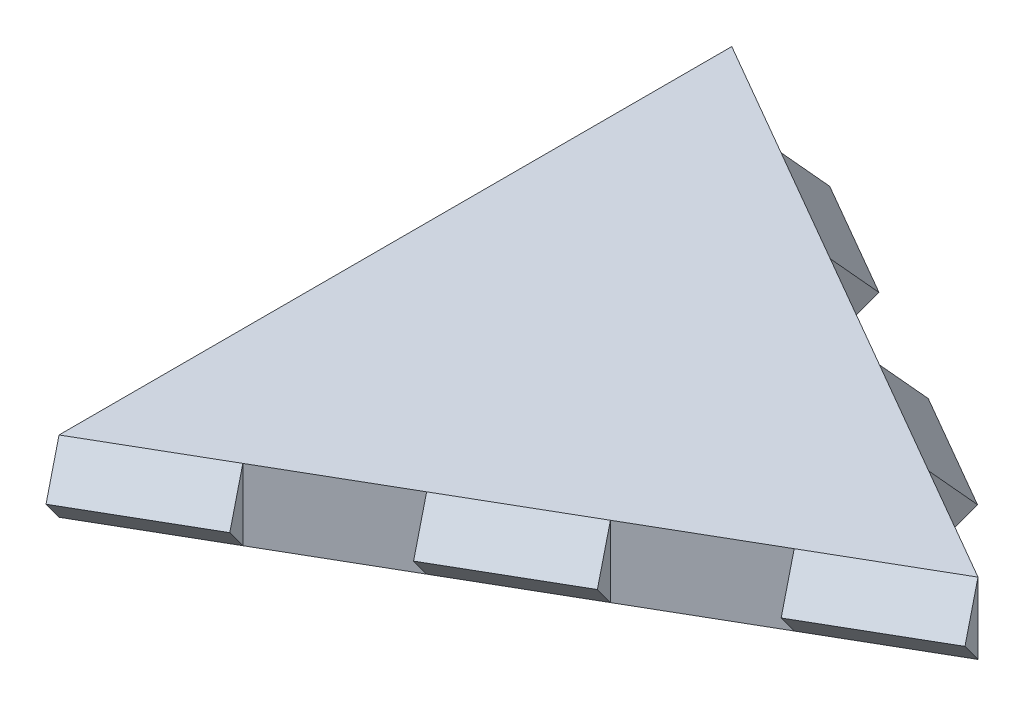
ISO-10303-21;
HEADER;
FILE_DESCRIPTION(('STEP AP214'),'2;1');
FILE_NAME('part.step','',(''),(''),'','','');
FILE_SCHEMA(('AUTOMOTIVE_DESIGN { 1 0 10303 214 1 1 1 1 }'));
ENDSEC;
DATA;
#1=APPLICATION_CONTEXT('core data for automotive mechanical design processes');
#2=APPLICATION_PROTOCOL_DEFINITION('international standard','automotive_design',2000,#1);
#3=PRODUCT_CONTEXT('',#1,'mechanical');
#4=PRODUCT('Part','Part','',(#3));
#5=PRODUCT_RELATED_PRODUCT_CATEGORY('part','',(#4));
#6=PRODUCT_DEFINITION_FORMATION('','',#4);
#7=PRODUCT_DEFINITION_CONTEXT('part definition',#1,'design');
#8=PRODUCT_DEFINITION('design','',#6,#7);
#9=PRODUCT_DEFINITION_SHAPE('','',#8);
#10=(LENGTH_UNIT() NAMED_UNIT(*) SI_UNIT(.MILLI.,.METRE.));
#11=(NAMED_UNIT(*) PLANE_ANGLE_UNIT() SI_UNIT($,.RADIAN.));
#12=(NAMED_UNIT(*) SI_UNIT($,.STERADIAN.) SOLID_ANGLE_UNIT());
#13=UNCERTAINTY_MEASURE_WITH_UNIT(LENGTH_MEASURE(1.E-05),#10,'distance_accuracy_value','');
#14=(GEOMETRIC_REPRESENTATION_CONTEXT(3) GLOBAL_UNCERTAINTY_ASSIGNED_CONTEXT((#13)) GLOBAL_UNIT_ASSIGNED_CONTEXT((#10,
#11,#12)) REPRESENTATION_CONTEXT('',''));
#15=CARTESIAN_POINT('',(0.,0.,0.));
#16=DIRECTION('',(0.,0.,1.));
#17=DIRECTION('',(1.,0.,0.));
#18=AXIS2_PLACEMENT_3D('',#15,#16,#17);
#19=CARTESIAN_POINT('',(0.,4.24,0.));
#20=DIRECTION('',(0.,1.,0.));
#21=DIRECTION('',(0.,0.,1.));
#22=AXIS2_PLACEMENT_3D('',#19,#20,#21);
#23=PLANE('',#22);
#24=DIRECTION('',(0.86602540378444,0.,0.499999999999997));
#25=VECTOR('',#24,1.);
#26=CARTESIAN_POINT('',(-22.1471563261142,4.24,-26.1199999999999));
#27=LINE('',#26,#25);
#28=CARTESIAN_POINT('',(-4.61880215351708,4.24,-15.9999999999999));
#29=VERTEX_POINT('',#28);
#30=CARTESIAN_POINT('',(2.30940107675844,4.24,-11.9999999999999));
#31=VERTEX_POINT('',#30);
#32=EDGE_CURVE('E191',#29,#31,#27,.T.);
#33=ORIENTED_EDGE('',*,*,#32,.F.);
#34=DIRECTION('',(0.866025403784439,0.,0.499999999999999));
#35=VECTOR('',#34,1.);
#36=CARTESIAN_POINT('',(-11.5470053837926,4.24,-19.9999999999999));
#37=LINE('',#36,#35);
#38=CARTESIAN_POINT('',(-11.5470053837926,4.24,-19.9999999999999));
#39=VERTEX_POINT('',#38);
#40=EDGE_CURVE('E226',#39,#29,#37,.T.);
#41=ORIENTED_EDGE('',*,*,#40,.F.);
#42=DIRECTION('',(0.,0.,-1.));
#43=VECTOR('',#42,1.);
#44=CARTESIAN_POINT('',(-11.5470053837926,4.24,-19.9999999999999));
#45=LINE('',#44,#43);
#46=CARTESIAN_POINT('',(-11.5470053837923,4.24,-12.));
#47=VERTEX_POINT('',#46);
#48=EDGE_CURVE('E290',#47,#39,#45,.T.);
#49=ORIENTED_EDGE('',*,*,#48,.F.);
#50=DIRECTION('',(0.,0.,1.));
#51=VECTOR('',#50,1.);
#52=CARTESIAN_POINT('',(-11.5470053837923,4.24,-22.24));
#53=LINE('',#52,#51);
#54=CARTESIAN_POINT('',(-11.5470053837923,4.24,-4.));
#55=VERTEX_POINT('',#54);
#56=EDGE_CURVE('E262',#47,#55,#53,.T.);
#57=ORIENTED_EDGE('',*,*,#56,.T.);
#58=DIRECTION('',(0.,0.,-1.));
#59=VECTOR('',#58,1.);
#60=CARTESIAN_POINT('',(-11.5470053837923,4.24,-4.));
#61=LINE('',#60,#59);
#62=CARTESIAN_POINT('',(-11.5470053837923,4.24,4.));
#63=VERTEX_POINT('',#62);
#64=EDGE_CURVE('E296',#63,#55,#61,.T.);
#65=ORIENTED_EDGE('',*,*,#64,.F.);
#66=CARTESIAN_POINT('',(-11.5470053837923,4.24,12.));
#67=VERTEX_POINT('',#66);
#68=EDGE_CURVE('E259',#63,#67,#53,.T.);
#69=ORIENTED_EDGE('',*,*,#68,.T.);
#70=DIRECTION('',(0.,0.,-1.));
#71=VECTOR('',#70,1.);
#72=CARTESIAN_POINT('',(-11.5470053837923,4.24,20.0000000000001));
#73=LINE('',#72,#71);
#74=CARTESIAN_POINT('',(-11.5470053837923,4.24,20.0000000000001));
#75=VERTEX_POINT('',#74);
#76=EDGE_CURVE('E285',#75,#67,#73,.T.);
#77=ORIENTED_EDGE('',*,*,#76,.F.);
#78=DIRECTION('',(-0.866025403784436,0.,0.500000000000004));
#79=VECTOR('',#78,1.);
#80=CARTESIAN_POINT('',(35.4262125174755,4.24,-7.12000000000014));
#81=LINE('',#80,#79);
#82=CARTESIAN_POINT('',(-4.61880215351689,4.24,16.0000000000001));
#83=VERTEX_POINT('',#82);
#84=EDGE_CURVE('E321',#83,#75,#81,.T.);
#85=ORIENTED_EDGE('',*,*,#84,.F.);
#86=DIRECTION('',(-0.866025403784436,0.,0.500000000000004));
#87=VECTOR('',#86,1.);
#88=CARTESIAN_POINT('',(2.3094010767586,4.24,12.0000000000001));
#89=LINE('',#88,#87);
#90=CARTESIAN_POINT('',(2.3094010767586,4.24,12.0000000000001));
#91=VERTEX_POINT('',#90);
#92=EDGE_CURVE('E359',#91,#83,#89,.T.);
#93=ORIENTED_EDGE('',*,*,#92,.F.);
#94=CARTESIAN_POINT('',(9.23760430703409,4.24,8.00000000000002));
#95=VERTEX_POINT('',#94);
#96=EDGE_CURVE('E334',#95,#91,#81,.T.);
#97=ORIENTED_EDGE('',*,*,#96,.F.);
#98=DIRECTION('',(-0.866025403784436,0.,0.500000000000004));
#99=VECTOR('',#98,1.);
#100=CARTESIAN_POINT('',(9.23760430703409,4.24,8.00000000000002));
#101=LINE('',#100,#99);
#102=CARTESIAN_POINT('',(16.1658075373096,4.24,3.99999999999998));
#103=VERTEX_POINT('',#102);
#104=EDGE_CURVE('E364',#103,#95,#101,.T.);
#105=ORIENTED_EDGE('',*,*,#104,.F.);
#106=CARTESIAN_POINT('',(23.094010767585,4.24,0.));
#107=VERTEX_POINT('',#106);
#108=EDGE_CURVE('E331',#107,#103,#81,.T.);
#109=ORIENTED_EDGE('',*,*,#108,.F.);
#110=DIRECTION('',(0.86602540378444,0.,0.499999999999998));
#111=VECTOR('',#110,1.);
#112=CARTESIAN_POINT('',(23.094010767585,4.24,0.));
#113=LINE('',#112,#111);
#114=CARTESIAN_POINT('',(16.1658075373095,4.24,-3.99999999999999));
#115=VERTEX_POINT('',#114);
#116=EDGE_CURVE('E230',#115,#107,#113,.T.);
#117=ORIENTED_EDGE('',*,*,#116,.F.);
#118=CARTESIAN_POINT('',(9.23760430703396,4.24,-7.99999999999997));
#119=VERTEX_POINT('',#118);
#120=EDGE_CURVE('E197',#119,#115,#27,.T.);
#121=ORIENTED_EDGE('',*,*,#120,.F.);
#122=DIRECTION('',(0.86602540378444,0.,0.499999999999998));
#123=VECTOR('',#122,1.);
#124=CARTESIAN_POINT('',(2.30940107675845,4.24,-12.));
#125=LINE('',#124,#123);
#126=EDGE_CURVE('E234',#31,#119,#125,.T.);
#127=ORIENTED_EDGE('',*,*,#126,.F.);
#128=EDGE_LOOP('',(#33,#41,#49,#57,#65,#69,#77,#85,#93,#97,#105,#109,#117,#121,#127));
#129=FACE_BOUND('',#128,.T.);
#130=ADVANCED_FACE('F33',(#129),#23,.T.);
#131=CARTESIAN_POINT('',(0.,0.,0.));
#132=DIRECTION('',(0.,1.,0.));
#133=DIRECTION('',(0.,0.,1.));
#134=AXIS2_PLACEMENT_3D('',#131,#132,#133);
#135=PLANE('',#134);
#136=DIRECTION('',(0.866025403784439,0.,0.499999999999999));
#137=VECTOR('',#136,1.);
#138=CARTESIAN_POINT('',(-11.5470053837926,0.,-19.9999999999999));
#139=LINE('',#138,#137);
#140=CARTESIAN_POINT('',(-11.5470053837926,0.,-19.9999999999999));
#141=VERTEX_POINT('',#140);
#142=CARTESIAN_POINT('',(-4.61880215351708,0.,-15.9999999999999));
#143=VERTEX_POINT('',#142);
#144=EDGE_CURVE('E235',#141,#143,#139,.T.);
#145=ORIENTED_EDGE('',*,*,#144,.T.);
#146=DIRECTION('',(0.86602540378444,0.,0.499999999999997));
#147=VECTOR('',#146,1.);
#148=CARTESIAN_POINT('',(-22.1471563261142,0.,-26.1199999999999));
#149=LINE('',#148,#147);
#150=CARTESIAN_POINT('',(2.30940107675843,0.,-11.9999999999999));
#151=VERTEX_POINT('',#150);
#152=EDGE_CURVE('E209',#143,#151,#149,.T.);
#153=ORIENTED_EDGE('',*,*,#152,.T.);
#154=DIRECTION('',(0.86602540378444,0.,0.499999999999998));
#155=VECTOR('',#154,1.);
#156=CARTESIAN_POINT('',(2.30940107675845,0.,-12.));
#157=LINE('',#156,#155);
#158=CARTESIAN_POINT('',(9.23760430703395,0.,-7.99999999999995));
#159=VERTEX_POINT('',#158);
#160=EDGE_CURVE('E242',#151,#159,#157,.T.);
#161=ORIENTED_EDGE('',*,*,#160,.T.);
#162=CARTESIAN_POINT('',(16.1658075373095,0.,-3.99999999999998));
#163=VERTEX_POINT('',#162);
#164=EDGE_CURVE('E208',#159,#163,#149,.T.);
#165=ORIENTED_EDGE('',*,*,#164,.T.);
#166=DIRECTION('',(0.86602540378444,0.,0.499999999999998));
#167=VECTOR('',#166,1.);
#168=CARTESIAN_POINT('',(23.094010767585,0.,0.));
#169=LINE('',#168,#167);
#170=CARTESIAN_POINT('',(23.094010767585,0.,0.));
#171=VERTEX_POINT('',#170);
#172=EDGE_CURVE('E227',#163,#171,#169,.T.);
#173=ORIENTED_EDGE('',*,*,#172,.T.);
#174=DIRECTION('',(-0.866025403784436,0.,0.500000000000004));
#175=VECTOR('',#174,1.);
#176=CARTESIAN_POINT('',(35.4262125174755,0.,-7.12000000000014));
#177=LINE('',#176,#175);
#178=CARTESIAN_POINT('',(16.1658075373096,0.,3.99999999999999));
#179=VERTEX_POINT('',#178);
#180=EDGE_CURVE('E327',#171,#179,#177,.T.);
#181=ORIENTED_EDGE('',*,*,#180,.T.);
#182=DIRECTION('',(-0.866025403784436,0.,0.500000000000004));
#183=VECTOR('',#182,1.);
#184=CARTESIAN_POINT('',(9.23760430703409,0.,8.00000000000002));
#185=LINE('',#184,#183);
#186=CARTESIAN_POINT('',(9.23760430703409,0.,8.00000000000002));
#187=VERTEX_POINT('',#186);
#188=EDGE_CURVE('E360',#179,#187,#185,.T.);
#189=ORIENTED_EDGE('',*,*,#188,.T.);
#190=CARTESIAN_POINT('',(2.3094010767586,0.,12.0000000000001));
#191=VERTEX_POINT('',#190);
#192=EDGE_CURVE('E325',#187,#191,#177,.T.);
#193=ORIENTED_EDGE('',*,*,#192,.T.);
#194=DIRECTION('',(-0.866025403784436,0.,0.500000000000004));
#195=VECTOR('',#194,1.);
#196=CARTESIAN_POINT('',(2.3094010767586,0.,12.0000000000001));
#197=LINE('',#196,#195);
#198=CARTESIAN_POINT('',(-4.61880215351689,0.,16.0000000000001));
#199=VERTEX_POINT('',#198);
#200=EDGE_CURVE('E374',#191,#199,#197,.T.);
#201=ORIENTED_EDGE('',*,*,#200,.T.);
#202=CARTESIAN_POINT('',(-11.5470053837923,0.,20.0000000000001));
#203=VERTEX_POINT('',#202);
#204=EDGE_CURVE('E322',#199,#203,#177,.T.);
#205=ORIENTED_EDGE('',*,*,#204,.T.);
#206=DIRECTION('',(0.,0.,-1.));
#207=VECTOR('',#206,1.);
#208=CARTESIAN_POINT('',(-11.5470053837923,0.,20.0000000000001));
#209=LINE('',#208,#207);
#210=CARTESIAN_POINT('',(-11.5470053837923,0.,12.));
#211=VERTEX_POINT('',#210);
#212=EDGE_CURVE('E297',#203,#211,#209,.T.);
#213=ORIENTED_EDGE('',*,*,#212,.T.);
#214=DIRECTION('',(0.,0.,1.));
#215=VECTOR('',#214,1.);
#216=CARTESIAN_POINT('',(-11.5470053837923,0.,-22.24));
#217=LINE('',#216,#215);
#218=CARTESIAN_POINT('',(-11.5470053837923,0.,4.));
#219=VERTEX_POINT('',#218);
#220=EDGE_CURVE('E258',#219,#211,#217,.T.);
#221=ORIENTED_EDGE('',*,*,#220,.F.);
#222=DIRECTION('',(0.,0.,-1.));
#223=VECTOR('',#222,1.);
#224=CARTESIAN_POINT('',(-11.5470053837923,0.,-4.));
#225=LINE('',#224,#223);
#226=CARTESIAN_POINT('',(-11.5470053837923,0.,-4.));
#227=VERTEX_POINT('',#226);
#228=EDGE_CURVE('E304',#219,#227,#225,.T.);
#229=ORIENTED_EDGE('',*,*,#228,.T.);
#230=CARTESIAN_POINT('',(-11.5470053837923,0.,-12.));
#231=VERTEX_POINT('',#230);
#232=EDGE_CURVE('E265',#231,#227,#217,.T.);
#233=ORIENTED_EDGE('',*,*,#232,.F.);
#234=DIRECTION('',(0.,0.,-1.));
#235=VECTOR('',#234,1.);
#236=CARTESIAN_POINT('',(-11.5470053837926,0.,-19.9999999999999));
#237=LINE('',#236,#235);
#238=EDGE_CURVE('E286',#231,#141,#237,.T.);
#239=ORIENTED_EDGE('',*,*,#238,.T.);
#240=EDGE_LOOP('',(#145,#153,#161,#165,#173,#181,#189,#193,#201,#205,#213,#221,#229,#233,#239));
#241=FACE_BOUND('',#240,.T.);
#242=ADVANCED_FACE('F35',(#241),#135,.F.);
#243=CARTESIAN_POINT('',(-9.4270053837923,4.24,23.6719477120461));
#244=DIRECTION('',(0.866025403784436,0.,-0.500000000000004));
#245=DIRECTION('',(-0.500000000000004,0.,-0.866025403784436));
#246=AXIS2_PLACEMENT_3D('',#243,#244,#245);
#247=PLANE('',#246);
#248=DIRECTION('',(0.,-1.,0.));
#249=VECTOR('',#248,1.);
#250=CARTESIAN_POINT('',(-11.5470053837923,4.24,20.0000000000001));
#251=LINE('',#250,#249);
#252=EDGE_CURVE('E371',#75,#203,#251,.T.);
#253=ORIENTED_EDGE('',*,*,#252,.T.);
#254=DIRECTION('',(-0.353553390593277,-0.707106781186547,-0.612372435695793));
#255=VECTOR('',#254,1.);
#256=CARTESIAN_POINT('',(-11.5470053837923,0.,20.0000000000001));
#257=LINE('',#256,#255);
#258=CARTESIAN_POINT('',(-10.4870053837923,2.12,21.8359738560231));
#259=VERTEX_POINT('',#258);
#260=EDGE_CURVE('E318',#259,#203,#257,.T.);
#261=ORIENTED_EDGE('',*,*,#260,.F.);
#262=DIRECTION('',(0.353553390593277,-0.707106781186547,0.612372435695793));
#263=VECTOR('',#262,1.);
#264=CARTESIAN_POINT('',(-11.5470053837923,4.24,20.0000000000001));
#265=LINE('',#264,#263);
#266=EDGE_CURVE('E313',#75,#259,#265,.T.);
#267=ORIENTED_EDGE('',*,*,#266,.F.);
#268=EDGE_LOOP('',(#253,#261,#267));
#269=FACE_BOUND('',#268,.T.);
#270=ADVANCED_FACE('F440',(#269),#247,.F.);
#271=CARTESIAN_POINT('',(25.214010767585,4.24,3.67194771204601));
#272=DIRECTION('',(-0.866025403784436,0.,0.500000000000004));
#273=DIRECTION('',(0.500000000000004,0.,0.866025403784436));
#274=AXIS2_PLACEMENT_3D('',#271,#272,#273);
#275=PLANE('',#274);
#276=DIRECTION('',(0.353553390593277,-0.707106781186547,0.612372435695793));
#277=VECTOR('',#276,1.);
#278=CARTESIAN_POINT('',(24.154010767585,2.12,1.83597385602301));
#279=LINE('',#278,#277);
#280=CARTESIAN_POINT('',(24.154010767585,2.12,1.83597385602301));
#281=VERTEX_POINT('',#280);
#282=EDGE_CURVE('E344',#107,#281,#279,.T.);
#283=ORIENTED_EDGE('',*,*,#282,.T.);
#284=DIRECTION('',(-0.353553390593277,-0.707106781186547,-0.612372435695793));
#285=VECTOR('',#284,1.);
#286=CARTESIAN_POINT('',(25.214010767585,4.24,3.67194771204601));
#287=LINE('',#286,#285);
#288=EDGE_CURVE('E356',#281,#171,#287,.T.);
#289=ORIENTED_EDGE('',*,*,#288,.T.);
#290=DIRECTION('',(0.,-1.,0.));
#291=VECTOR('',#290,1.);
#292=CARTESIAN_POINT('',(23.094010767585,4.24,0.));
#293=LINE('',#292,#291);
#294=EDGE_CURVE('E389',#107,#171,#293,.T.);
#295=ORIENTED_EDGE('',*,*,#294,.F.);
#296=EDGE_LOOP('',(#283,#289,#295));
#297=FACE_BOUND('',#296,.T.);
#298=ADVANCED_FACE('F422',(#297),#275,.F.);
#299=CARTESIAN_POINT('',(-4.61880215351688,0.,16.0000000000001));
#300=DIRECTION('',(-0.866025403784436,0.,0.500000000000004));
#301=DIRECTION('',(0.500000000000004,0.,0.866025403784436));
#302=AXIS2_PLACEMENT_3D('',#299,#300,#301);
#303=PLANE('',#302);
#304=DIRECTION('',(0.353553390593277,-0.707106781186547,0.612372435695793));
#305=VECTOR('',#304,1.);
#306=CARTESIAN_POINT('',(-3.55880215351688,2.12,17.8359738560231));
#307=LINE('',#306,#305);
#308=CARTESIAN_POINT('',(-3.55880215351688,2.12,17.8359738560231));
#309=VERTEX_POINT('',#308);
#310=EDGE_CURVE('E341',#83,#309,#307,.T.);
#311=ORIENTED_EDGE('',*,*,#310,.T.);
#312=DIRECTION('',(-0.353553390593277,-0.707106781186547,-0.612372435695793));
#313=VECTOR('',#312,1.);
#314=CARTESIAN_POINT('',(-4.61880215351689,0.,16.0000000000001));
#315=LINE('',#314,#313);
#316=EDGE_CURVE('E353',#309,#199,#315,.T.);
#317=ORIENTED_EDGE('',*,*,#316,.T.);
#318=DIRECTION('',(0.,1.,0.));
#319=VECTOR('',#318,1.);
#320=CARTESIAN_POINT('',(-4.61880215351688,0.,16.0000000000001));
#321=LINE('',#320,#319);
#322=EDGE_CURVE('E367',#199,#83,#321,.T.);
#323=ORIENTED_EDGE('',*,*,#322,.T.);
#324=EDGE_LOOP('',(#311,#317,#323));
#325=FACE_BOUND('',#324,.T.);
#326=ADVANCED_FACE('F449',(#325),#303,.F.);
#327=CARTESIAN_POINT('',(2.3094010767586,0.,12.0000000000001));
#328=DIRECTION('',(-0.500000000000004,0.,-0.866025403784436));
#329=DIRECTION('',(-0.866025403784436,0.,0.500000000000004));
#330=AXIS2_PLACEMENT_3D('',#327,#328,#329);
#331=PLANE('',#330);
#332=ORIENTED_EDGE('',*,*,#92,.T.);
#333=ORIENTED_EDGE('',*,*,#322,.F.);
#334=ORIENTED_EDGE('',*,*,#200,.F.);
#335=DIRECTION('',(0.,1.,0.));
#336=VECTOR('',#335,1.);
#337=CARTESIAN_POINT('',(2.3094010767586,0.,12.0000000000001));
#338=LINE('',#337,#336);
#339=EDGE_CURVE('E377',#191,#91,#338,.T.);
#340=ORIENTED_EDGE('',*,*,#339,.T.);
#341=EDGE_LOOP('',(#332,#333,#334,#340));
#342=FACE_BOUND('',#341,.T.);
#343=ADVANCED_FACE('F433',(#342),#331,.F.);
#344=CARTESIAN_POINT('',(4.42940107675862,0.,15.6719477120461));
#345=DIRECTION('',(0.866025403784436,0.,-0.500000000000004));
#346=DIRECTION('',(-0.500000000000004,0.,-0.866025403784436));
#347=AXIS2_PLACEMENT_3D('',#344,#345,#346);
#348=PLANE('',#347);
#349=ORIENTED_EDGE('',*,*,#339,.F.);
#350=DIRECTION('',(0.353553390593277,0.707106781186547,0.612372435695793));
#351=VECTOR('',#350,1.);
#352=CARTESIAN_POINT('',(3.36940107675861,2.12,13.8359738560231));
#353=LINE('',#352,#351);
#354=CARTESIAN_POINT('',(3.36940107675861,2.12,13.8359738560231));
#355=VERTEX_POINT('',#354);
#356=EDGE_CURVE('E350',#191,#355,#353,.T.);
#357=ORIENTED_EDGE('',*,*,#356,.T.);
#358=DIRECTION('',(-0.353553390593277,0.707106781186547,-0.612372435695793));
#359=VECTOR('',#358,1.);
#360=CARTESIAN_POINT('',(4.42940107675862,0.,15.6719477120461));
#361=LINE('',#360,#359);
#362=EDGE_CURVE('E338',#355,#91,#361,.T.);
#363=ORIENTED_EDGE('',*,*,#362,.T.);
#364=EDGE_LOOP('',(#349,#357,#363));
#365=FACE_BOUND('',#364,.T.);
#366=ADVANCED_FACE('F429',(#365),#348,.F.);
#367=CARTESIAN_POINT('',(11.3576043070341,0.,11.671947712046));
#368=DIRECTION('',(-0.866025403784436,0.,0.500000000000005));
#369=DIRECTION('',(0.500000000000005,0.,0.866025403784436));
#370=AXIS2_PLACEMENT_3D('',#367,#368,#369);
#371=PLANE('',#370);
#372=DIRECTION('',(0.353553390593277,-0.707106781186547,0.612372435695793));
#373=VECTOR('',#372,1.);
#374=CARTESIAN_POINT('',(11.3576043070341,0.,11.671947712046));
#375=LINE('',#374,#373);
#376=CARTESIAN_POINT('',(10.2976043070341,2.12,9.83597385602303));
#377=VERTEX_POINT('',#376);
#378=EDGE_CURVE('E335',#95,#377,#375,.T.);
#379=ORIENTED_EDGE('',*,*,#378,.T.);
#380=DIRECTION('',(-0.353553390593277,-0.707106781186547,-0.612372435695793));
#381=VECTOR('',#380,1.);
#382=CARTESIAN_POINT('',(10.2976043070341,2.12,9.83597385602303));
#383=LINE('',#382,#381);
#384=EDGE_CURVE('E347',#377,#187,#383,.T.);
#385=ORIENTED_EDGE('',*,*,#384,.T.);
#386=DIRECTION('',(0.,1.,0.));
#387=VECTOR('',#386,1.);
#388=CARTESIAN_POINT('',(9.23760430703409,0.,8.00000000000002));
#389=LINE('',#388,#387);
#390=EDGE_CURVE('E368',#187,#95,#389,.T.);
#391=ORIENTED_EDGE('',*,*,#390,.T.);
#392=EDGE_LOOP('',(#379,#385,#391));
#393=FACE_BOUND('',#392,.T.);
#394=ADVANCED_FACE('F412',(#393),#371,.F.);
#395=CARTESIAN_POINT('',(9.23760430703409,0.,8.00000000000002));
#396=DIRECTION('',(-0.500000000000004,0.,-0.866025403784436));
#397=DIRECTION('',(-0.866025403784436,0.,0.500000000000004));
#398=AXIS2_PLACEMENT_3D('',#395,#396,#397);
#399=PLANE('',#398);
#400=ORIENTED_EDGE('',*,*,#104,.T.);
#401=ORIENTED_EDGE('',*,*,#390,.F.);
#402=ORIENTED_EDGE('',*,*,#188,.F.);
#403=DIRECTION('',(0.,1.,0.));
#404=VECTOR('',#403,1.);
#405=CARTESIAN_POINT('',(16.1658075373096,0.,3.99999999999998));
#406=LINE('',#405,#404);
#407=EDGE_CURVE('E363',#179,#103,#406,.T.);
#408=ORIENTED_EDGE('',*,*,#407,.T.);
#409=EDGE_LOOP('',(#400,#401,#402,#408));
#410=FACE_BOUND('',#409,.T.);
#411=ADVANCED_FACE('F400',(#410),#399,.F.);
#412=CARTESIAN_POINT('',(16.1658075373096,0.,3.99999999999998));
#413=DIRECTION('',(0.866025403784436,0.,-0.500000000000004));
#414=DIRECTION('',(-0.500000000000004,0.,-0.866025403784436));
#415=AXIS2_PLACEMENT_3D('',#412,#413,#414);
#416=PLANE('',#415);
#417=ORIENTED_EDGE('',*,*,#407,.F.);
#418=DIRECTION('',(0.353553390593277,0.707106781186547,0.612372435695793));
#419=VECTOR('',#418,1.);
#420=CARTESIAN_POINT('',(16.1658075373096,0.,3.99999999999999));
#421=LINE('',#420,#419);
#422=CARTESIAN_POINT('',(17.2258075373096,2.12,5.83597385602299));
#423=VERTEX_POINT('',#422);
#424=EDGE_CURVE('E11',#179,#423,#421,.T.);
#425=ORIENTED_EDGE('',*,*,#424,.T.);
#426=DIRECTION('',(-0.353553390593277,0.707106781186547,-0.612372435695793));
#427=VECTOR('',#426,1.);
#428=CARTESIAN_POINT('',(17.2258075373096,2.12,5.83597385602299));
#429=LINE('',#428,#427);
#430=EDGE_CURVE('E41',#423,#103,#429,.T.);
#431=ORIENTED_EDGE('',*,*,#430,.T.);
#432=EDGE_LOOP('',(#417,#425,#431));
#433=FACE_BOUND('',#432,.T.);
#434=ADVANCED_FACE('F393',(#433),#416,.F.);
#435=CARTESIAN_POINT('',(35.4262125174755,4.24,-7.12000000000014));
#436=DIRECTION('',(-0.353553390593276,-0.707106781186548,-0.612372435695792));
#437=DIRECTION('',(0.,0.654653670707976,-0.755928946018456));
#438=AXIS2_PLACEMENT_3D('',#435,#436,#437);
#439=PLANE('',#438);
#440=ORIENTED_EDGE('',*,*,#108,.T.);
#441=ORIENTED_EDGE('',*,*,#430,.F.);
#442=DIRECTION('',(-0.866025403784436,0.,0.500000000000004));
#443=VECTOR('',#442,1.);
#444=CARTESIAN_POINT('',(36.4862125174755,2.12,-5.28402614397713));
#445=LINE('',#444,#443);
#446=EDGE_CURVE('E326',#281,#423,#445,.T.);
#447=ORIENTED_EDGE('',*,*,#446,.F.);
#448=ORIENTED_EDGE('',*,*,#282,.F.);
#449=EDGE_LOOP('',(#440,#441,#447,#448));
#450=FACE_BOUND('',#449,.T.);
#451=ADVANCED_FACE('F424',(#450),#439,.F.);
#452=CARTESIAN_POINT('',(35.4262125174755,0.,-7.12000000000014));
#453=DIRECTION('',(-0.353553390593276,0.707106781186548,-0.612372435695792));
#454=DIRECTION('',(0.,0.654653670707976,0.755928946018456));
#455=AXIS2_PLACEMENT_3D('',#452,#453,#454);
#456=PLANE('',#455);
#457=ORIENTED_EDGE('',*,*,#446,.T.);
#458=ORIENTED_EDGE('',*,*,#424,.F.);
#459=ORIENTED_EDGE('',*,*,#180,.F.);
#460=ORIENTED_EDGE('',*,*,#288,.F.);
#461=EDGE_LOOP('',(#457,#458,#459,#460));
#462=FACE_BOUND('',#461,.T.);
#463=ADVANCED_FACE('F420',(#462),#456,.F.);
#464=EDGE_CURVE('E330',#377,#355,#445,.T.);
#465=ORIENTED_EDGE('',*,*,#464,.F.);
#466=ORIENTED_EDGE('',*,*,#378,.F.);
#467=ORIENTED_EDGE('',*,*,#96,.T.);
#468=ORIENTED_EDGE('',*,*,#362,.F.);
#469=EDGE_LOOP('',(#465,#466,#467,#468));
#470=FACE_BOUND('',#469,.T.);
#471=ADVANCED_FACE('F459',(#470),#439,.F.);
#472=ORIENTED_EDGE('',*,*,#192,.F.);
#473=ORIENTED_EDGE('',*,*,#384,.F.);
#474=ORIENTED_EDGE('',*,*,#464,.T.);
#475=ORIENTED_EDGE('',*,*,#356,.F.);
#476=EDGE_LOOP('',(#472,#473,#474,#475));
#477=FACE_BOUND('',#476,.T.);
#478=ADVANCED_FACE('F427',(#477),#456,.F.);
#479=EDGE_CURVE('E328',#309,#259,#445,.T.);
#480=ORIENTED_EDGE('',*,*,#479,.T.);
#481=ORIENTED_EDGE('',*,*,#260,.T.);
#482=ORIENTED_EDGE('',*,*,#204,.F.);
#483=ORIENTED_EDGE('',*,*,#316,.F.);
#484=EDGE_LOOP('',(#480,#481,#482,#483));
#485=FACE_BOUND('',#484,.T.);
#486=ADVANCED_FACE('F450',(#485),#456,.F.);
#487=ORIENTED_EDGE('',*,*,#84,.T.);
#488=ORIENTED_EDGE('',*,*,#266,.T.);
#489=ORIENTED_EDGE('',*,*,#479,.F.);
#490=ORIENTED_EDGE('',*,*,#310,.F.);
#491=EDGE_LOOP('',(#487,#488,#489,#490));
#492=FACE_BOUND('',#491,.T.);
#493=ADVANCED_FACE('F447',(#492),#439,.F.);
#494=CARTESIAN_POINT('',(-15.7870053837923,0.,-4.));
#495=DIRECTION('',(0.,0.,-1.));
#496=DIRECTION('',(-1.,0.,0.));
#497=AXIS2_PLACEMENT_3D('',#494,#495,#496);
#498=PLANE('',#497);
#499=DIRECTION('',(0.,1.,0.));
#500=VECTOR('',#499,1.);
#501=CARTESIAN_POINT('',(-11.5470053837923,0.,-4.));
#502=LINE('',#501,#500);
#503=EDGE_CURVE('E310',#227,#55,#502,.T.);
#504=ORIENTED_EDGE('',*,*,#503,.T.);
#505=DIRECTION('',(-0.707106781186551,-0.707106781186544,0.));
#506=VECTOR('',#505,1.);
#507=CARTESIAN_POINT('',(-15.7870053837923,0.,-4.));
#508=LINE('',#507,#506);
#509=CARTESIAN_POINT('',(-13.6670053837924,2.12,-4.));
#510=VERTEX_POINT('',#509);
#511=EDGE_CURVE('E282',#55,#510,#508,.T.);
#512=ORIENTED_EDGE('',*,*,#511,.T.);
#513=DIRECTION('',(0.707106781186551,-0.707106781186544,0.));
#514=VECTOR('',#513,1.);
#515=CARTESIAN_POINT('',(-13.6670053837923,2.12,-4.));
#516=LINE('',#515,#514);
#517=EDGE_CURVE('E273',#510,#227,#516,.T.);
#518=ORIENTED_EDGE('',*,*,#517,.T.);
#519=EDGE_LOOP('',(#504,#512,#518));
#520=FACE_BOUND('',#519,.T.);
#521=ADVANCED_FACE('F457',(#520),#498,.F.);
#522=CARTESIAN_POINT('',(-11.5470053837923,0.,-4.));
#523=DIRECTION('',(1.,0.,0.));
#524=DIRECTION('',(0.,0.,-1.));
#525=AXIS2_PLACEMENT_3D('',#522,#523,#524);
#526=PLANE('',#525);
#527=ORIENTED_EDGE('',*,*,#64,.T.);
#528=ORIENTED_EDGE('',*,*,#503,.F.);
#529=ORIENTED_EDGE('',*,*,#228,.F.);
#530=DIRECTION('',(0.,1.,0.));
#531=VECTOR('',#530,1.);
#532=CARTESIAN_POINT('',(-11.5470053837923,0.,4.));
#533=LINE('',#532,#531);
#534=EDGE_CURVE('E307',#219,#63,#533,.T.);
#535=ORIENTED_EDGE('',*,*,#534,.T.);
#536=EDGE_LOOP('',(#527,#528,#529,#535));
#537=FACE_BOUND('',#536,.T.);
#538=ADVANCED_FACE('F523',(#537),#526,.F.);
#539=CARTESIAN_POINT('',(-15.7870053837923,0.,4.));
#540=DIRECTION('',(0.,0.,1.));
#541=DIRECTION('',(1.,0.,0.));
#542=AXIS2_PLACEMENT_3D('',#539,#540,#541);
#543=PLANE('',#542);
#544=DIRECTION('',(-0.707106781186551,0.707106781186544,0.));
#545=VECTOR('',#544,1.);
#546=CARTESIAN_POINT('',(-13.6670053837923,2.12,4.));
#547=LINE('',#546,#545);
#548=CARTESIAN_POINT('',(-13.6670053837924,2.12,4.));
#549=VERTEX_POINT('',#548);
#550=EDGE_CURVE('E270',#219,#549,#547,.T.);
#551=ORIENTED_EDGE('',*,*,#550,.T.);
#552=DIRECTION('',(0.707106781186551,0.707106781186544,0.));
#553=VECTOR('',#552,1.);
#554=CARTESIAN_POINT('',(-15.7870053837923,0.,4.));
#555=LINE('',#554,#553);
#556=EDGE_CURVE('E279',#549,#63,#555,.T.);
#557=ORIENTED_EDGE('',*,*,#556,.T.);
#558=ORIENTED_EDGE('',*,*,#534,.F.);
#559=EDGE_LOOP('',(#551,#557,#558));
#560=FACE_BOUND('',#559,.T.);
#561=ADVANCED_FACE('F534',(#560),#543,.F.);
#562=CARTESIAN_POINT('',(-11.5470053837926,0.,-19.9999999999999));
#563=DIRECTION('',(1.,0.,0.));
#564=DIRECTION('',(0.,0.,-1.));
#565=AXIS2_PLACEMENT_3D('',#562,#563,#564);
#566=PLANE('',#565);
#567=ORIENTED_EDGE('',*,*,#48,.T.);
#568=DIRECTION('',(0.,-1.,0.));
#569=VECTOR('',#568,1.);
#570=CARTESIAN_POINT('',(-11.5470053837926,4.24,-19.9999999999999));
#571=LINE('',#570,#569);
#572=EDGE_CURVE('E386',#39,#141,#571,.T.);
#573=ORIENTED_EDGE('',*,*,#572,.T.);
#574=ORIENTED_EDGE('',*,*,#238,.F.);
#575=DIRECTION('',(0.,1.,0.));
#576=VECTOR('',#575,1.);
#577=CARTESIAN_POINT('',(-11.5470053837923,0.,-12.));
#578=LINE('',#577,#576);
#579=EDGE_CURVE('E289',#231,#47,#578,.T.);
#580=ORIENTED_EDGE('',*,*,#579,.T.);
#581=EDGE_LOOP('',(#567,#573,#574,#580));
#582=FACE_BOUND('',#581,.T.);
#583=ADVANCED_FACE('F544',(#582),#566,.F.);
#584=CARTESIAN_POINT('',(-11.5470053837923,0.,-12.));
#585=DIRECTION('',(0.,0.,1.));
#586=DIRECTION('',(1.,0.,0.));
#587=AXIS2_PLACEMENT_3D('',#584,#585,#586);
#588=PLANE('',#587);
#589=DIRECTION('',(-0.707106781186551,0.707106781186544,0.));
#590=VECTOR('',#589,1.);
#591=CARTESIAN_POINT('',(-11.5470053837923,0.,-12.));
#592=LINE('',#591,#590);
#593=CARTESIAN_POINT('',(-13.6670053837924,2.12,-12.));
#594=VERTEX_POINT('',#593);
#595=EDGE_CURVE('E267',#231,#594,#592,.T.);
#596=ORIENTED_EDGE('',*,*,#595,.T.);
#597=DIRECTION('',(0.707106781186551,0.707106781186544,0.));
#598=VECTOR('',#597,1.);
#599=CARTESIAN_POINT('',(-13.6670053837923,2.12000000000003,-12.));
#600=LINE('',#599,#598);
#601=EDGE_CURVE('E276',#594,#47,#600,.T.);
#602=ORIENTED_EDGE('',*,*,#601,.T.);
#603=ORIENTED_EDGE('',*,*,#579,.F.);
#604=EDGE_LOOP('',(#596,#602,#603));
#605=FACE_BOUND('',#604,.T.);
#606=ADVANCED_FACE('F551',(#605),#588,.F.);
#607=CARTESIAN_POINT('',(-11.5470053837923,0.,12.));
#608=DIRECTION('',(0.,0.,-1.));
#609=DIRECTION('',(-1.,0.,0.));
#610=AXIS2_PLACEMENT_3D('',#607,#608,#609);
#611=PLANE('',#610);
#612=DIRECTION('',(0.,1.,0.));
#613=VECTOR('',#612,1.);
#614=CARTESIAN_POINT('',(-11.5470053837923,0.,12.));
#615=LINE('',#614,#613);
#616=EDGE_CURVE('E293',#211,#67,#615,.T.);
#617=ORIENTED_EDGE('',*,*,#616,.T.);
#618=DIRECTION('',(0.707106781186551,0.707106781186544,0.));
#619=VECTOR('',#618,1.);
#620=CARTESIAN_POINT('',(-11.5470053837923,4.24,12.));
#621=LINE('',#620,#619);
#622=CARTESIAN_POINT('',(-13.6670053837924,2.12,12.));
#623=VERTEX_POINT('',#622);
#624=EDGE_CURVE('E256',#623,#67,#621,.T.);
#625=ORIENTED_EDGE('',*,*,#624,.F.);
#626=DIRECTION('',(-0.707106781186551,0.707106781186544,0.));
#627=VECTOR('',#626,1.);
#628=CARTESIAN_POINT('',(-13.6670053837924,2.12,12.));
#629=LINE('',#628,#627);
#630=EDGE_CURVE('E251',#211,#623,#629,.T.);
#631=ORIENTED_EDGE('',*,*,#630,.F.);
#632=EDGE_LOOP('',(#617,#625,#631));
#633=FACE_BOUND('',#632,.T.);
#634=ADVANCED_FACE('F556',(#633),#611,.F.);
#635=CARTESIAN_POINT('',(-11.5470053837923,0.,20.0000000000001));
#636=DIRECTION('',(1.,0.,0.));
#637=DIRECTION('',(0.,0.,-1.));
#638=AXIS2_PLACEMENT_3D('',#635,#636,#637);
#639=PLANE('',#638);
#640=ORIENTED_EDGE('',*,*,#76,.T.);
#641=ORIENTED_EDGE('',*,*,#616,.F.);
#642=ORIENTED_EDGE('',*,*,#212,.F.);
#643=ORIENTED_EDGE('',*,*,#252,.F.);
#644=EDGE_LOOP('',(#640,#641,#642,#643));
#645=FACE_BOUND('',#644,.T.);
#646=ADVANCED_FACE('F443',(#645),#639,.F.);
#647=CARTESIAN_POINT('',(-13.6670053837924,2.12,-22.24));
#648=DIRECTION('',(0.707106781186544,0.707106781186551,0.));
#649=DIRECTION('',(-0.707106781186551,0.707106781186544,0.));
#650=AXIS2_PLACEMENT_3D('',#647,#648,#649);
#651=PLANE('',#650);
#652=ORIENTED_EDGE('',*,*,#220,.T.);
#653=ORIENTED_EDGE('',*,*,#630,.T.);
#654=DIRECTION('',(0.,0.,1.));
#655=VECTOR('',#654,1.);
#656=CARTESIAN_POINT('',(-13.6670053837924,2.12,-22.24));
#657=LINE('',#656,#655);
#658=EDGE_CURVE('E263',#549,#623,#657,.T.);
#659=ORIENTED_EDGE('',*,*,#658,.F.);
#660=ORIENTED_EDGE('',*,*,#550,.F.);
#661=EDGE_LOOP('',(#652,#653,#659,#660));
#662=FACE_BOUND('',#661,.T.);
#663=ADVANCED_FACE('F575',(#662),#651,.F.);
#664=CARTESIAN_POINT('',(-11.5470053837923,4.24,-22.24));
#665=DIRECTION('',(0.707106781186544,-0.707106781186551,0.));
#666=DIRECTION('',(0.707106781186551,0.707106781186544,0.));
#667=AXIS2_PLACEMENT_3D('',#664,#665,#666);
#668=PLANE('',#667);
#669=ORIENTED_EDGE('',*,*,#658,.T.);
#670=ORIENTED_EDGE('',*,*,#624,.T.);
#671=ORIENTED_EDGE('',*,*,#68,.F.);
#672=ORIENTED_EDGE('',*,*,#556,.F.);
#673=EDGE_LOOP('',(#669,#670,#671,#672));
#674=FACE_BOUND('',#673,.T.);
#675=ADVANCED_FACE('F584',(#674),#668,.F.);
#676=ORIENTED_EDGE('',*,*,#56,.F.);
#677=ORIENTED_EDGE('',*,*,#601,.F.);
#678=EDGE_CURVE('E56',#594,#510,#657,.T.);
#679=ORIENTED_EDGE('',*,*,#678,.T.);
#680=ORIENTED_EDGE('',*,*,#511,.F.);
#681=EDGE_LOOP('',(#676,#677,#679,#680));
#682=FACE_BOUND('',#681,.T.);
#683=ADVANCED_FACE('F595',(#682),#668,.F.);
#684=ORIENTED_EDGE('',*,*,#678,.F.);
#685=ORIENTED_EDGE('',*,*,#595,.F.);
#686=ORIENTED_EDGE('',*,*,#232,.T.);
#687=ORIENTED_EDGE('',*,*,#517,.F.);
#688=EDGE_LOOP('',(#684,#685,#686,#687));
#689=FACE_BOUND('',#688,.T.);
#690=ADVANCED_FACE('F587',(#689),#651,.F.);
#691=CARTESIAN_POINT('',(11.357604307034,0.,-11.671947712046));
#692=DIRECTION('',(0.86602540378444,0.,0.499999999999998));
#693=DIRECTION('',(0.499999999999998,0.,-0.86602540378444));
#694=AXIS2_PLACEMENT_3D('',#691,#692,#693);
#695=PLANE('',#694);
#696=DIRECTION('',(0.353553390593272,-0.707106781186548,-0.612372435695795));
#697=VECTOR('',#696,1.);
#698=CARTESIAN_POINT('',(11.357604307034,0.,-11.671947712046));
#699=LINE('',#698,#697);
#700=CARTESIAN_POINT('',(10.2976043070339,2.12000000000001,-9.83597385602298));
#701=VERTEX_POINT('',#700);
#702=EDGE_CURVE('E217',#119,#701,#699,.T.);
#703=ORIENTED_EDGE('',*,*,#702,.T.);
#704=DIRECTION('',(-0.353553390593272,-0.707106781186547,0.612372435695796));
#705=VECTOR('',#704,1.);
#706=CARTESIAN_POINT('',(10.297604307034,2.12000000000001,-9.83597385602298));
#707=LINE('',#706,#705);
#708=EDGE_CURVE('E188',#701,#159,#707,.T.);
#709=ORIENTED_EDGE('',*,*,#708,.T.);
#710=DIRECTION('',(0.,1.,0.));
#711=VECTOR('',#710,1.);
#712=CARTESIAN_POINT('',(9.23760430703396,0.,-7.99999999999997));
#713=LINE('',#712,#711);
#714=EDGE_CURVE('E248',#159,#119,#713,.T.);
#715=ORIENTED_EDGE('',*,*,#714,.T.);
#716=EDGE_LOOP('',(#703,#709,#715));
#717=FACE_BOUND('',#716,.T.);
#718=ADVANCED_FACE('F613',(#717),#695,.F.);
#719=CARTESIAN_POINT('',(2.30940107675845,0.,-12.));
#720=DIRECTION('',(-0.499999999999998,0.,0.86602540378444));
#721=DIRECTION('',(0.86602540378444,0.,0.499999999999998));
#722=AXIS2_PLACEMENT_3D('',#719,#720,#721);
#723=PLANE('',#722);
#724=ORIENTED_EDGE('',*,*,#126,.T.);
#725=ORIENTED_EDGE('',*,*,#714,.F.);
#726=ORIENTED_EDGE('',*,*,#160,.F.);
#727=DIRECTION('',(0.,1.,0.));
#728=VECTOR('',#727,1.);
#729=CARTESIAN_POINT('',(2.30940107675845,0.,-12.));
#730=LINE('',#729,#728);
#731=EDGE_CURVE('E245',#151,#31,#730,.T.);
#732=ORIENTED_EDGE('',*,*,#731,.T.);
#733=EDGE_LOOP('',(#724,#725,#726,#732));
#734=FACE_BOUND('',#733,.T.);
#735=ADVANCED_FACE('F653',(#734),#723,.F.);
#736=CARTESIAN_POINT('',(4.42940107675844,0.,-15.671947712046));
#737=DIRECTION('',(-0.86602540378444,0.,-0.499999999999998));
#738=DIRECTION('',(-0.499999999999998,0.,0.86602540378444));
#739=AXIS2_PLACEMENT_3D('',#736,#737,#738);
#740=PLANE('',#739);
#741=ORIENTED_EDGE('',*,*,#731,.F.);
#742=DIRECTION('',(0.353553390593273,0.707106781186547,-0.612372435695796));
#743=VECTOR('',#742,1.);
#744=CARTESIAN_POINT('',(3.36940107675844,2.12000000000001,-13.835973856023));
#745=LINE('',#744,#743);
#746=CARTESIAN_POINT('',(3.36940107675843,2.12,-13.8359738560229));
#747=VERTEX_POINT('',#746);
#748=EDGE_CURVE('E222',#151,#747,#745,.T.);
#749=ORIENTED_EDGE('',*,*,#748,.T.);
#750=DIRECTION('',(-0.353553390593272,0.707106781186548,0.612372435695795));
#751=VECTOR('',#750,1.);
#752=CARTESIAN_POINT('',(4.42940107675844,0.,-15.671947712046));
#753=LINE('',#752,#751);
#754=EDGE_CURVE('E214',#747,#31,#753,.T.);
#755=ORIENTED_EDGE('',*,*,#754,.T.);
#756=EDGE_LOOP('',(#741,#749,#755));
#757=FACE_BOUND('',#756,.T.);
#758=ADVANCED_FACE('F663',(#757),#740,.F.);
#759=CARTESIAN_POINT('',(23.094010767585,0.,0.));
#760=DIRECTION('',(-0.499999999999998,0.,0.86602540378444));
#761=DIRECTION('',(0.86602540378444,0.,0.499999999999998));
#762=AXIS2_PLACEMENT_3D('',#759,#760,#761);
#763=PLANE('',#762);
#764=ORIENTED_EDGE('',*,*,#116,.T.);
#765=ORIENTED_EDGE('',*,*,#294,.T.);
#766=ORIENTED_EDGE('',*,*,#172,.F.);
#767=DIRECTION('',(0.,1.,0.));
#768=VECTOR('',#767,1.);
#769=CARTESIAN_POINT('',(16.1658075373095,0.,-3.99999999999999));
#770=LINE('',#769,#768);
#771=EDGE_CURVE('E203',#163,#115,#770,.T.);
#772=ORIENTED_EDGE('',*,*,#771,.T.);
#773=EDGE_LOOP('',(#764,#765,#766,#772));
#774=FACE_BOUND('',#773,.T.);
#775=ADVANCED_FACE('F673',(#774),#763,.F.);
#776=CARTESIAN_POINT('',(16.1658075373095,0.,-3.99999999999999));
#777=DIRECTION('',(-0.86602540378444,0.,-0.499999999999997));
#778=DIRECTION('',(-0.499999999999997,0.,0.86602540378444));
#779=AXIS2_PLACEMENT_3D('',#776,#777,#778);
#780=PLANE('',#779);
#781=ORIENTED_EDGE('',*,*,#771,.F.);
#782=DIRECTION('',(-0.353553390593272,-0.707106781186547,0.612372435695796));
#783=VECTOR('',#782,1.);
#784=CARTESIAN_POINT('',(17.2258075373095,2.12,-5.835973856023));
#785=LINE('',#784,#783);
#786=CARTESIAN_POINT('',(17.2258075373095,2.12,-5.835973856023));
#787=VERTEX_POINT('',#786);
#788=EDGE_CURVE('E185',#787,#163,#785,.T.);
#789=ORIENTED_EDGE('',*,*,#788,.F.);
#790=DIRECTION('',(0.353553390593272,-0.707106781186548,-0.612372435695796));
#791=VECTOR('',#790,1.);
#792=CARTESIAN_POINT('',(16.1658075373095,4.24,-3.99999999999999));
#793=LINE('',#792,#791);
#794=EDGE_CURVE('E194',#115,#787,#793,.T.);
#795=ORIENTED_EDGE('',*,*,#794,.F.);
#796=EDGE_LOOP('',(#781,#789,#795));
#797=FACE_BOUND('',#796,.T.);
#798=ADVANCED_FACE('F202',(#797),#780,.F.);
#799=CARTESIAN_POINT('',(-4.61880215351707,0.,-15.9999999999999));
#800=DIRECTION('',(0.86602540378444,0.,0.499999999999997));
#801=DIRECTION('',(0.499999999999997,0.,-0.86602540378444));
#802=AXIS2_PLACEMENT_3D('',#799,#800,#801);
#803=PLANE('',#802);
#804=DIRECTION('',(0.353553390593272,-0.707106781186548,-0.612372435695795));
#805=VECTOR('',#804,1.);
#806=CARTESIAN_POINT('',(-3.55880215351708,2.11999999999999,-17.8359738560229));
#807=LINE('',#806,#805);
#808=CARTESIAN_POINT('',(-3.55880215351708,2.12,-17.8359738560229));
#809=VERTEX_POINT('',#808);
#810=EDGE_CURVE('E211',#29,#809,#807,.T.);
#811=ORIENTED_EDGE('',*,*,#810,.T.);
#812=DIRECTION('',(-0.353553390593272,-0.707106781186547,0.612372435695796));
#813=VECTOR('',#812,1.);
#814=CARTESIAN_POINT('',(-4.61880215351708,0.,-15.9999999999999));
#815=LINE('',#814,#813);
#816=EDGE_CURVE('E219',#809,#143,#815,.T.);
#817=ORIENTED_EDGE('',*,*,#816,.T.);
#818=DIRECTION('',(0.,1.,0.));
#819=VECTOR('',#818,1.);
#820=CARTESIAN_POINT('',(-4.61880215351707,0.,-15.9999999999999));
#821=LINE('',#820,#819);
#822=EDGE_CURVE('E232',#143,#29,#821,.T.);
#823=ORIENTED_EDGE('',*,*,#822,.T.);
#824=EDGE_LOOP('',(#811,#817,#823));
#825=FACE_BOUND('',#824,.T.);
#826=ADVANCED_FACE('F692',(#825),#803,.F.);
#827=CARTESIAN_POINT('',(-11.5470053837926,0.,-19.9999999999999));
#828=DIRECTION('',(-0.499999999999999,0.,0.866025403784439));
#829=DIRECTION('',(0.866025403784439,0.,0.499999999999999));
#830=AXIS2_PLACEMENT_3D('',#827,#828,#829);
#831=PLANE('',#830);
#832=ORIENTED_EDGE('',*,*,#40,.T.);
#833=ORIENTED_EDGE('',*,*,#822,.F.);
#834=ORIENTED_EDGE('',*,*,#144,.F.);
#835=ORIENTED_EDGE('',*,*,#572,.F.);
#836=EDGE_LOOP('',(#832,#833,#834,#835));
#837=FACE_BOUND('',#836,.T.);
#838=ADVANCED_FACE('F701',(#837),#831,.F.);
#839=CARTESIAN_POINT('',(-22.1471563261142,4.24,-26.1199999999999));
#840=DIRECTION('',(-0.353553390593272,-0.707106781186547,0.612372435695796));
#841=DIRECTION('',(0.,-0.654653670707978,-0.755928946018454));
#842=AXIS2_PLACEMENT_3D('',#839,#840,#841);
#843=PLANE('',#842);
#844=DIRECTION('',(0.86602540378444,0.,0.499999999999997));
#845=VECTOR('',#844,1.);
#846=CARTESIAN_POINT('',(-21.0871563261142,2.12,-27.9559738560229));
#847=LINE('',#846,#845);
#848=EDGE_CURVE('E48',#809,#747,#847,.T.);
#849=ORIENTED_EDGE('',*,*,#848,.F.);
#850=ORIENTED_EDGE('',*,*,#810,.F.);
#851=ORIENTED_EDGE('',*,*,#32,.T.);
#852=ORIENTED_EDGE('',*,*,#754,.F.);
#853=EDGE_LOOP('',(#849,#850,#851,#852));
#854=FACE_BOUND('',#853,.T.);
#855=ADVANCED_FACE('F711',(#854),#843,.F.);
#856=CARTESIAN_POINT('',(-21.0871563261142,2.12,-27.9559738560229));
#857=DIRECTION('',(-0.353553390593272,0.707106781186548,0.612372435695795));
#858=DIRECTION('',(0.,-0.654653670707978,0.755928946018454));
#859=AXIS2_PLACEMENT_3D('',#856,#857,#858);
#860=PLANE('',#859);
#861=ORIENTED_EDGE('',*,*,#152,.F.);
#862=ORIENTED_EDGE('',*,*,#816,.F.);
#863=ORIENTED_EDGE('',*,*,#848,.T.);
#864=ORIENTED_EDGE('',*,*,#748,.F.);
#865=EDGE_LOOP('',(#861,#862,#863,#864));
#866=FACE_BOUND('',#865,.T.);
#867=ADVANCED_FACE('F721',(#866),#860,.F.);
#868=EDGE_CURVE('E181',#701,#787,#847,.T.);
#869=ORIENTED_EDGE('',*,*,#868,.T.);
#870=ORIENTED_EDGE('',*,*,#788,.T.);
#871=ORIENTED_EDGE('',*,*,#164,.F.);
#872=ORIENTED_EDGE('',*,*,#708,.F.);
#873=EDGE_LOOP('',(#869,#870,#871,#872));
#874=FACE_BOUND('',#873,.T.);
#875=ADVANCED_FACE('F183',(#874),#860,.F.);
#876=ORIENTED_EDGE('',*,*,#120,.T.);
#877=ORIENTED_EDGE('',*,*,#794,.T.);
#878=ORIENTED_EDGE('',*,*,#868,.F.);
#879=ORIENTED_EDGE('',*,*,#702,.F.);
#880=EDGE_LOOP('',(#876,#877,#878,#879));
#881=FACE_BOUND('',#880,.T.);
#882=ADVANCED_FACE('F195',(#881),#843,.F.);
#883=CLOSED_SHELL('',(#130,#242,#270,#298,#326,#343,#366,#394,#411,#434,#451,#463,#471,#478,
#486,#493,#521,#538,#561,#583,#606,#634,#646,#663,#675,#683,#690,#718,#735,#758,#775,#798,#826,
#838,#855,#867,#875,#882));
#884=MANIFOLD_SOLID_BREP('B2',#883);
#885=ADVANCED_BREP_SHAPE_REPRESENTATION('',(#18,#884),#14);
#886=SHAPE_DEFINITION_REPRESENTATION(#9,#885);
ENDSEC;
END-ISO-10303-21;
